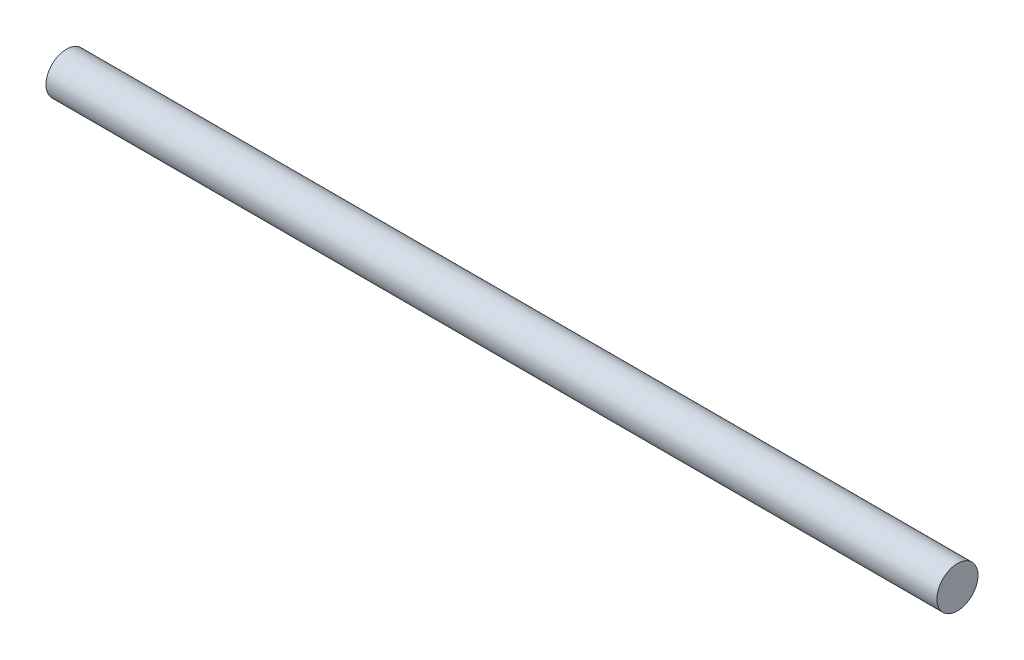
from build123d import *

# Parameters (mm, degrees)
SKETCH1_R           = 1.5
BOSS_EXTRUDE1_DEPTH = 65


with BuildPart() as part:
    # Sketch1 → Boss-Extrude1 (new body)
    with BuildSketch(Plane(origin=(0, 0, 0), x_dir=(0, 0, -1), z_dir=(1, 0, 0))):
        Circle(SKETCH1_R)
    extrude(amount=BOSS_EXTRUDE1_DEPTH)


solid = part.part
